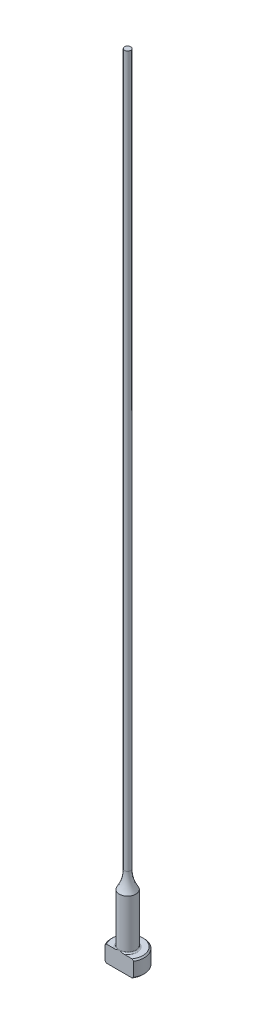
from build123d import *

# Parameters (mm, degrees)
CHAMFER1_SIZE = 0.254
FILLET1_R     = 0.254
KEY_DEPTH     = 153.466131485


with BuildPart() as part:
    # Sketch1 → Revolve1 (revolve)
    with BuildSketch(Plane.XY, mode=Mode.PRIVATE) as revolve1_sk:
        with BuildLine():
            Line((0, 0), (-3.175, 0))
            Line((-3.175, 0), (-3.175, 3.175))
            Line((-3.175, 3.175), (-1.5875, 3.175))
            Line((-1.5875, 3.175), (-1.5875, 12.7))
            ThreePointArc((-1.5875, 12.7), (-0.847698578, 14.334042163), (-0.59436, 16.109772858))
            Line((-0.59436, 16.109772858), (-0.59436, 152.4))
            Line((-0.59436, 152.4), (0, 152.4))
            Line((0, 152.4), (0, 0))
        make_face()
    revolve(revolve1_sk.sketch.rotate(Axis((0, 259.958771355, 0), (0, -1, 0)), 270), axis=Axis((0, 259.958771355, 0), (0, -1, 0)))

    # Chamfer1
    chamfer1_edges = [part.edges().sort_by_distance(p)[0] for p in [
        (0, 0, -3.175),
        (0, 3.175, -3.175),
    ]]
    chamfer(chamfer1_edges, length=CHAMFER1_SIZE)

    # Fillet1
    fillet1_edges = [part.edges().sort_by_distance(p)[0] for p in [
        (0, 3.175, -1.5875),
    ]]
    fillet(fillet1_edges, radius=FILLET1_R)

    # Sketch2 → KEY (cut, through all)
    with BuildSketch(Plane.XZ):
        with BuildLine():
            Line((-2.749630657, 1.5875), (2.749630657, 1.5875))
            ThreePointArc((2.749630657, 1.5875), (0, 3.175), (-2.749630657, 1.5875))
        make_face()
    extrude(amount=-KEY_DEPTH, mode=Mode.SUBTRACT)


solid = part.part
